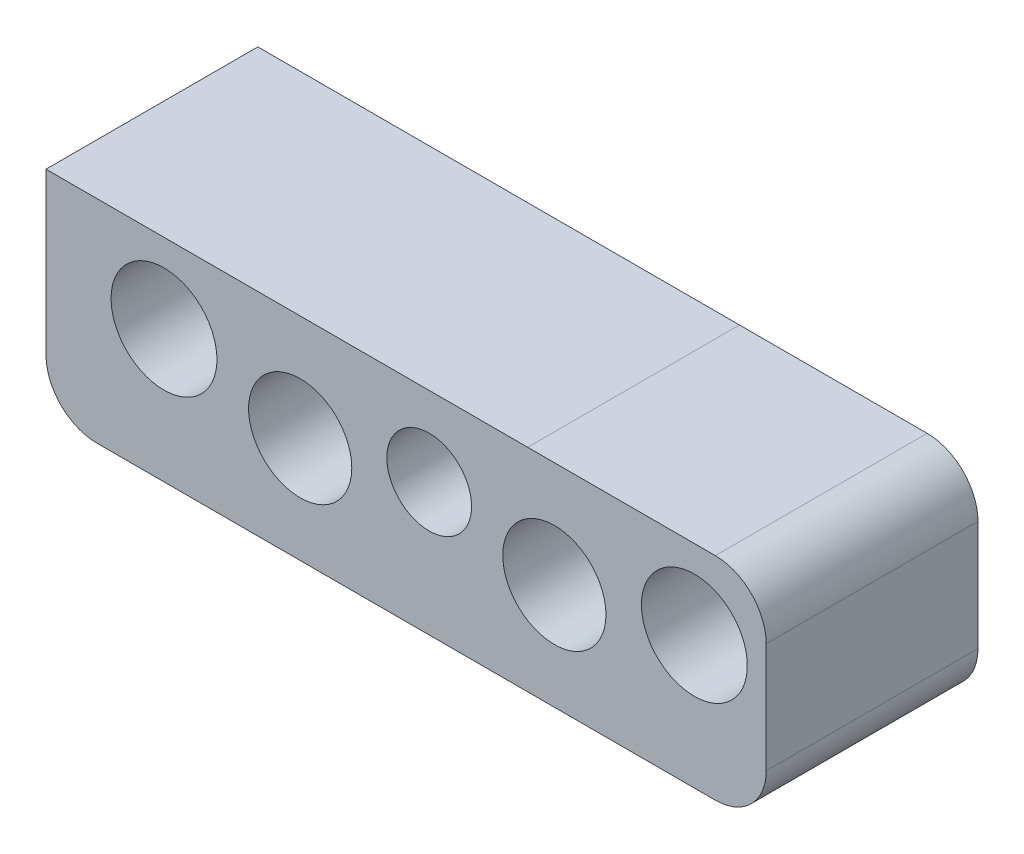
ISO-10303-21;
HEADER;
FILE_DESCRIPTION(('STEP AP214'),'2;1');
FILE_NAME('part.step','',(''),(''),'','','');
FILE_SCHEMA(('AUTOMOTIVE_DESIGN { 1 0 10303 214 1 1 1 1 }'));
ENDSEC;
DATA;
#1=APPLICATION_CONTEXT('core data for automotive mechanical design processes');
#2=APPLICATION_PROTOCOL_DEFINITION('international standard','automotive_design',2000,#1);
#3=PRODUCT_CONTEXT('',#1,'mechanical');
#4=PRODUCT('Part','Part','',(#3));
#5=PRODUCT_RELATED_PRODUCT_CATEGORY('part','',(#4));
#6=PRODUCT_DEFINITION_FORMATION('','',#4);
#7=PRODUCT_DEFINITION_CONTEXT('part definition',#1,'design');
#8=PRODUCT_DEFINITION('design','',#6,#7);
#9=PRODUCT_DEFINITION_SHAPE('','',#8);
#10=(LENGTH_UNIT() NAMED_UNIT(*) SI_UNIT(.MILLI.,.METRE.));
#11=(NAMED_UNIT(*) PLANE_ANGLE_UNIT() SI_UNIT($,.RADIAN.));
#12=(NAMED_UNIT(*) SI_UNIT($,.STERADIAN.) SOLID_ANGLE_UNIT());
#13=UNCERTAINTY_MEASURE_WITH_UNIT(LENGTH_MEASURE(1.E-05),#10,'distance_accuracy_value','');
#14=(GEOMETRIC_REPRESENTATION_CONTEXT(3) GLOBAL_UNCERTAINTY_ASSIGNED_CONTEXT((#13)) GLOBAL_UNIT_ASSIGNED_CONTEXT((#10,
#11,#12)) REPRESENTATION_CONTEXT('',''));
#15=CARTESIAN_POINT('',(0.,0.,0.));
#16=DIRECTION('',(0.,0.,1.));
#17=DIRECTION('',(1.,0.,0.));
#18=AXIS2_PLACEMENT_3D('',#15,#16,#17);
#19=CARTESIAN_POINT('',(-937.768,-19.05,-0.0100000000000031));
#20=DIRECTION('',(0.,1.,0.));
#21=DIRECTION('',(0.,0.,1.));
#22=AXIS2_PLACEMENT_3D('',#19,#20,#21);
#23=PLANE('',#22);
#24=DIRECTION('',(1.,0.,0.));
#25=VECTOR('',#24,1.);
#26=CARTESIAN_POINT('',(0.,-19.05,0.));
#27=LINE('',#26,#25);
#28=CARTESIAN_POINT('',(-865.5685,-19.05,0.));
#29=VERTEX_POINT('',#28);
#30=CARTESIAN_POINT('',(-837.438,-19.05,0.));
#31=VERTEX_POINT('',#30);
#32=EDGE_CURVE('E124',#29,#31,#27,.T.);
#33=ORIENTED_EDGE('',*,*,#32,.F.);
#34=DIRECTION('',(0.,0.,1.));
#35=VECTOR('',#34,1.);
#36=CARTESIAN_POINT('',(-865.5685,-19.05,0.));
#37=LINE('',#36,#35);
#38=CARTESIAN_POINT('',(-865.5685,-19.05,31.75));
#39=VERTEX_POINT('',#38);
#40=EDGE_CURVE('E108',#29,#39,#37,.T.);
#41=ORIENTED_EDGE('',*,*,#40,.T.);
#42=DIRECTION('',(1.,0.,0.));
#43=VECTOR('',#42,1.);
#44=CARTESIAN_POINT('',(0.,-19.05,31.75));
#45=LINE('',#44,#43);
#46=CARTESIAN_POINT('',(-837.438,-19.05,31.75));
#47=VERTEX_POINT('',#46);
#48=EDGE_CURVE('E115',#39,#47,#45,.T.);
#49=ORIENTED_EDGE('',*,*,#48,.T.);
#50=DIRECTION('',(0.,0.,1.));
#51=VECTOR('',#50,1.);
#52=CARTESIAN_POINT('',(-837.438,-19.05,-0.0100000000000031));
#53=LINE('',#52,#51);
#54=EDGE_CURVE('E11',#31,#47,#53,.T.);
#55=ORIENTED_EDGE('',*,*,#54,.F.);
#56=EDGE_LOOP('',(#33,#41,#49,#55));
#57=FACE_BOUND('',#56,.T.);
#58=ADVANCED_FACE('F41',(#57),#23,.T.);
#59=CARTESIAN_POINT('',(-837.438,-26.67,-0.0100000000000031));
#60=DIRECTION('',(0.,0.,1.));
#61=DIRECTION('',(1.,0.,0.));
#62=AXIS2_PLACEMENT_3D('',#59,#60,#61);
#63=CYLINDRICAL_SURFACE('',#62,7.61999999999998);
#64=CARTESIAN_POINT('',(-837.438,-26.67,0.));
#65=DIRECTION('',(0.,0.,-1.));
#66=DIRECTION('',(-1.,0.,0.));
#67=AXIS2_PLACEMENT_3D('',#64,#65,#66);
#68=CIRCLE('',#67,7.61999999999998);
#69=CARTESIAN_POINT('',(-829.818,-26.6700000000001,0.));
#70=VERTEX_POINT('',#69);
#71=EDGE_CURVE('E154',#31,#70,#68,.T.);
#72=ORIENTED_EDGE('',*,*,#71,.F.);
#73=ORIENTED_EDGE('',*,*,#54,.T.);
#74=CARTESIAN_POINT('',(-837.438,-26.67,31.75));
#75=DIRECTION('',(0.,0.,-1.));
#76=DIRECTION('',(-1.,0.,0.));
#77=AXIS2_PLACEMENT_3D('',#74,#75,#76);
#78=CIRCLE('',#77,7.61999999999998);
#79=CARTESIAN_POINT('',(-829.818,-26.6700000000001,31.75));
#80=VERTEX_POINT('',#79);
#81=EDGE_CURVE('E119',#47,#80,#78,.T.);
#82=ORIENTED_EDGE('',*,*,#81,.T.);
#83=DIRECTION('',(0.,0.,1.));
#84=VECTOR('',#83,1.);
#85=CARTESIAN_POINT('',(-829.818,-26.6700000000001,-0.0100000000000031));
#86=LINE('',#85,#84);
#87=EDGE_CURVE('E50',#70,#80,#86,.T.);
#88=ORIENTED_EDGE('',*,*,#87,.F.);
#89=EDGE_LOOP('',(#72,#73,#82,#88));
#90=FACE_BOUND('',#89,.T.);
#91=ADVANCED_FACE('F186',(#90),#63,.T.);
#92=CARTESIAN_POINT('',(-829.818,-26.6700000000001,-0.0100000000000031));
#93=DIRECTION('',(1.,0.,0.));
#94=DIRECTION('',(0.,0.,-1.));
#95=AXIS2_PLACEMENT_3D('',#92,#93,#94);
#96=PLANE('',#95);
#97=DIRECTION('',(0.,-1.,0.));
#98=VECTOR('',#97,1.);
#99=CARTESIAN_POINT('',(-829.818,0.,0.));
#100=LINE('',#99,#98);
#101=CARTESIAN_POINT('',(-829.818,-43.18,0.));
#102=VERTEX_POINT('',#101);
#103=EDGE_CURVE('E157',#70,#102,#100,.T.);
#104=ORIENTED_EDGE('',*,*,#103,.F.);
#105=ORIENTED_EDGE('',*,*,#87,.T.);
#106=DIRECTION('',(0.,-1.,0.));
#107=VECTOR('',#106,1.);
#108=CARTESIAN_POINT('',(-829.818,0.,31.75));
#109=LINE('',#108,#107);
#110=CARTESIAN_POINT('',(-829.818,-43.18,31.75));
#111=VERTEX_POINT('',#110);
#112=EDGE_CURVE('E182',#80,#111,#109,.T.);
#113=ORIENTED_EDGE('',*,*,#112,.T.);
#114=DIRECTION('',(0.,0.,1.));
#115=VECTOR('',#114,1.);
#116=CARTESIAN_POINT('',(-829.818,-43.18,-0.0100000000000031));
#117=LINE('',#116,#115);
#118=EDGE_CURVE('E144',#102,#111,#117,.T.);
#119=ORIENTED_EDGE('',*,*,#118,.F.);
#120=EDGE_LOOP('',(#104,#105,#113,#119));
#121=FACE_BOUND('',#120,.T.);
#122=ADVANCED_FACE('F191',(#121),#96,.T.);
#123=CARTESIAN_POINT('',(-837.438,-43.18,-0.0100000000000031));
#124=DIRECTION('',(0.,0.,1.));
#125=DIRECTION('',(1.,0.,0.));
#126=AXIS2_PLACEMENT_3D('',#123,#124,#125);
#127=CYLINDRICAL_SURFACE('',#126,7.61999999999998);
#128=CARTESIAN_POINT('',(-837.438,-43.18,0.));
#129=DIRECTION('',(0.,0.,-1.));
#130=DIRECTION('',(-1.,0.,0.));
#131=AXIS2_PLACEMENT_3D('',#128,#129,#130);
#132=CIRCLE('',#131,7.61999999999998);
#133=CARTESIAN_POINT('',(-837.438,-50.8,0.));
#134=VERTEX_POINT('',#133);
#135=EDGE_CURVE('E160',#102,#134,#132,.T.);
#136=ORIENTED_EDGE('',*,*,#135,.F.);
#137=ORIENTED_EDGE('',*,*,#118,.T.);
#138=CARTESIAN_POINT('',(-837.438,-43.18,31.75));
#139=DIRECTION('',(0.,0.,-1.));
#140=DIRECTION('',(-1.,0.,0.));
#141=AXIS2_PLACEMENT_3D('',#138,#139,#140);
#142=CIRCLE('',#141,7.61999999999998);
#143=CARTESIAN_POINT('',(-837.438,-50.8,31.75));
#144=VERTEX_POINT('',#143);
#145=EDGE_CURVE('E179',#111,#144,#142,.T.);
#146=ORIENTED_EDGE('',*,*,#145,.T.);
#147=DIRECTION('',(0.,0.,1.));
#148=VECTOR('',#147,1.);
#149=CARTESIAN_POINT('',(-837.438,-50.8,-0.0100000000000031));
#150=LINE('',#149,#148);
#151=EDGE_CURVE('E146',#134,#144,#150,.T.);
#152=ORIENTED_EDGE('',*,*,#151,.F.);
#153=EDGE_LOOP('',(#136,#137,#146,#152));
#154=FACE_BOUND('',#153,.T.);
#155=ADVANCED_FACE('F195',(#154),#127,.T.);
#156=CARTESIAN_POINT('',(-930.148,-50.8,-0.0100000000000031));
#157=DIRECTION('',(0.,-1.,0.));
#158=DIRECTION('',(0.,0.,-1.));
#159=AXIS2_PLACEMENT_3D('',#156,#157,#158);
#160=PLANE('',#159);
#161=DIRECTION('',(-1.,0.,0.));
#162=VECTOR('',#161,1.);
#163=CARTESIAN_POINT('',(0.,-50.8,0.));
#164=LINE('',#163,#162);
#165=CARTESIAN_POINT('',(-930.148,-50.8,0.));
#166=VERTEX_POINT('',#165);
#167=EDGE_CURVE('E163',#134,#166,#164,.T.);
#168=ORIENTED_EDGE('',*,*,#167,.F.);
#169=ORIENTED_EDGE('',*,*,#151,.T.);
#170=DIRECTION('',(-1.,0.,0.));
#171=VECTOR('',#170,1.);
#172=CARTESIAN_POINT('',(0.,-50.8,31.75));
#173=LINE('',#172,#171);
#174=CARTESIAN_POINT('',(-930.148,-50.8,31.75));
#175=VERTEX_POINT('',#174);
#176=EDGE_CURVE('E176',#144,#175,#173,.T.);
#177=ORIENTED_EDGE('',*,*,#176,.T.);
#178=DIRECTION('',(0.,0.,1.));
#179=VECTOR('',#178,1.);
#180=CARTESIAN_POINT('',(-930.148,-50.8,-0.0100000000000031));
#181=LINE('',#180,#179);
#182=EDGE_CURVE('E148',#166,#175,#181,.T.);
#183=ORIENTED_EDGE('',*,*,#182,.F.);
#184=EDGE_LOOP('',(#168,#169,#177,#183));
#185=FACE_BOUND('',#184,.T.);
#186=ADVANCED_FACE('F197',(#185),#160,.T.);
#187=CARTESIAN_POINT('',(-937.768,-19.05,-0.0100000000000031));
#188=DIRECTION('',(-1.,0.,0.));
#189=DIRECTION('',(0.,0.,1.));
#190=AXIS2_PLACEMENT_3D('',#187,#188,#189);
#191=PLANE('',#190);
#192=DIRECTION('',(0.,1.,0.));
#193=VECTOR('',#192,1.);
#194=CARTESIAN_POINT('',(-937.768,0.,0.));
#195=LINE('',#194,#193);
#196=CARTESIAN_POINT('',(-937.768,-43.18,0.));
#197=VERTEX_POINT('',#196);
#198=CARTESIAN_POINT('',(-937.768,-19.05,0.));
#199=VERTEX_POINT('',#198);
#200=EDGE_CURVE('E169',#197,#199,#195,.T.);
#201=ORIENTED_EDGE('',*,*,#200,.F.);
#202=DIRECTION('',(0.,0.,1.));
#203=VECTOR('',#202,1.);
#204=CARTESIAN_POINT('',(-937.768,-43.18,-0.0100000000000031));
#205=LINE('',#204,#203);
#206=CARTESIAN_POINT('',(-937.768,-43.18,31.75));
#207=VERTEX_POINT('',#206);
#208=EDGE_CURVE('E111',#197,#207,#205,.T.);
#209=ORIENTED_EDGE('',*,*,#208,.T.);
#210=DIRECTION('',(0.,1.,0.));
#211=VECTOR('',#210,1.);
#212=CARTESIAN_POINT('',(-937.768,0.,31.75));
#213=LINE('',#212,#211);
#214=CARTESIAN_POINT('',(-937.768,-19.05,31.75));
#215=VERTEX_POINT('',#214);
#216=EDGE_CURVE('E171',#207,#215,#213,.T.);
#217=ORIENTED_EDGE('',*,*,#216,.T.);
#218=DIRECTION('',(0.,0.,1.));
#219=VECTOR('',#218,1.);
#220=CARTESIAN_POINT('',(-937.768,-19.05,-0.0100000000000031));
#221=LINE('',#220,#219);
#222=EDGE_CURVE('E58',#199,#215,#221,.T.);
#223=ORIENTED_EDGE('',*,*,#222,.F.);
#224=EDGE_LOOP('',(#201,#209,#217,#223));
#225=FACE_BOUND('',#224,.T.);
#226=ADVANCED_FACE('F202',(#225),#191,.T.);
#227=CARTESIAN_POINT('',(-930.148,-43.18,-0.0100000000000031));
#228=DIRECTION('',(0.,0.,1.));
#229=DIRECTION('',(1.,0.,0.));
#230=AXIS2_PLACEMENT_3D('',#227,#228,#229);
#231=CYLINDRICAL_SURFACE('',#230,7.61999999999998);
#232=CARTESIAN_POINT('',(-930.148,-43.18,0.));
#233=DIRECTION('',(0.,0.,-1.));
#234=DIRECTION('',(-1.,0.,0.));
#235=AXIS2_PLACEMENT_3D('',#232,#233,#234);
#236=CIRCLE('',#235,7.61999999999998);
#237=EDGE_CURVE('E166',#166,#197,#236,.T.);
#238=ORIENTED_EDGE('',*,*,#237,.F.);
#239=ORIENTED_EDGE('',*,*,#182,.T.);
#240=CARTESIAN_POINT('',(-930.148,-43.18,31.75));
#241=DIRECTION('',(0.,0.,-1.));
#242=DIRECTION('',(-1.,0.,0.));
#243=AXIS2_PLACEMENT_3D('',#240,#241,#242);
#244=CIRCLE('',#243,7.61999999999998);
#245=EDGE_CURVE('E173',#175,#207,#244,.T.);
#246=ORIENTED_EDGE('',*,*,#245,.T.);
#247=ORIENTED_EDGE('',*,*,#208,.F.);
#248=EDGE_LOOP('',(#238,#239,#246,#247));
#249=FACE_BOUND('',#248,.T.);
#250=ADVANCED_FACE('F201',(#249),#231,.T.);
#251=CARTESIAN_POINT('',(-832.643295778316,-30.9504062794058,11.1252));
#252=DIRECTION('',(0.,0.,1.));
#253=DIRECTION('',(1.,0.,0.));
#254=AXIS2_PLACEMENT_3D('',#251,#252,#253);
#255=PLANE('',#254);
#256=CARTESIAN_POINT('',(-840.580795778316,-30.9504062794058,11.1252));
#257=DIRECTION('',(0.,0.,-1.));
#258=DIRECTION('',(-1.,0.,0.));
#259=AXIS2_PLACEMENT_3D('',#256,#257,#258);
#260=CIRCLE('',#259,7.93750000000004);
#261=CARTESIAN_POINT('',(-848.518295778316,-30.9504062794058,11.1252));
#262=VERTEX_POINT('',#261);
#263=EDGE_CURVE('E134',#262,#262,#260,.T.);
#264=ORIENTED_EDGE('',*,*,#263,.F.);
#265=EDGE_LOOP('',(#264));
#266=FACE_BOUND('',#265,.T.);
#267=CARTESIAN_POINT('',(-840.580795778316,-30.9504062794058,11.1252));
#268=DIRECTION('',(0.,0.,-1.));
#269=DIRECTION('',(-1.,0.,0.));
#270=AXIS2_PLACEMENT_3D('',#267,#268,#269);
#271=CIRCLE('',#270,9.92187499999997);
#272=CARTESIAN_POINT('',(-850.502670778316,-30.9504062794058,11.1252));
#273=VERTEX_POINT('',#272);
#274=EDGE_CURVE('E139',#273,#273,#271,.T.);
#275=ORIENTED_EDGE('',*,*,#274,.T.);
#276=EDGE_LOOP('',(#275));
#277=FACE_BOUND('',#276,.T.);
#278=ADVANCED_FACE('F209',(#266,#277),#255,.F.);
#279=CARTESIAN_POINT('',(-873.981795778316,-30.9504062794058,11.1252));
#280=DIRECTION('',(0.,0.,1.));
#281=DIRECTION('',(1.,0.,0.));
#282=AXIS2_PLACEMENT_3D('',#279,#280,#281);
#283=PLANE('',#282);
#284=CARTESIAN_POINT('',(-880.331795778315,-30.9504062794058,11.1252));
#285=DIRECTION('',(0.,0.,-1.));
#286=DIRECTION('',(-1.,0.,0.));
#287=AXIS2_PLACEMENT_3D('',#284,#285,#286);
#288=CIRCLE('',#287,6.34999999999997);
#289=CARTESIAN_POINT('',(-886.681795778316,-30.9504062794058,11.1252));
#290=VERTEX_POINT('',#289);
#291=EDGE_CURVE('E480',#290,#290,#288,.T.);
#292=ORIENTED_EDGE('',*,*,#291,.F.);
#293=EDGE_LOOP('',(#292));
#294=FACE_BOUND('',#293,.T.);
#295=CARTESIAN_POINT('',(-880.331795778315,-30.9504062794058,11.1252));
#296=DIRECTION('',(0.,0.,-1.));
#297=DIRECTION('',(-1.,0.,0.));
#298=AXIS2_PLACEMENT_3D('',#295,#296,#297);
#299=CIRCLE('',#298,8.73124999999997);
#300=CARTESIAN_POINT('',(-889.063045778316,-30.9504062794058,11.1252));
#301=VERTEX_POINT('',#300);
#302=EDGE_CURVE('E477',#301,#301,#299,.T.);
#303=ORIENTED_EDGE('',*,*,#302,.T.);
#304=EDGE_LOOP('',(#303));
#305=FACE_BOUND('',#304,.T.);
#306=ADVANCED_FACE('F227',(#294,#305),#283,.F.);
#307=CARTESIAN_POINT('',(-912.145295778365,-30.9504062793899,4.7752));
#308=DIRECTION('',(0.,0.,1.));
#309=DIRECTION('',(1.,0.,0.));
#310=AXIS2_PLACEMENT_3D('',#307,#308,#309);
#311=PLANE('',#310);
#312=CARTESIAN_POINT('',(-920.082795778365,-30.9504062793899,4.7752));
#313=DIRECTION('',(0.,0.,-1.));
#314=DIRECTION('',(-1.,0.,0.));
#315=AXIS2_PLACEMENT_3D('',#312,#313,#314);
#316=CIRCLE('',#315,7.93750000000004);
#317=CARTESIAN_POINT('',(-928.020295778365,-30.9504062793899,4.7752));
#318=VERTEX_POINT('',#317);
#319=EDGE_CURVE('E468',#318,#318,#316,.T.);
#320=ORIENTED_EDGE('',*,*,#319,.F.);
#321=EDGE_LOOP('',(#320));
#322=FACE_BOUND('',#321,.T.);
#323=CARTESIAN_POINT('',(-920.082795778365,-30.9504062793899,4.7752));
#324=DIRECTION('',(0.,0.,-1.));
#325=DIRECTION('',(-1.,0.,0.));
#326=AXIS2_PLACEMENT_3D('',#323,#324,#325);
#327=CIRCLE('',#326,9.92187499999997);
#328=CARTESIAN_POINT('',(-930.004670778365,-30.9504062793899,4.7752));
#329=VERTEX_POINT('',#328);
#330=EDGE_CURVE('E465',#329,#329,#327,.T.);
#331=ORIENTED_EDGE('',*,*,#330,.T.);
#332=EDGE_LOOP('',(#331));
#333=FACE_BOUND('',#332,.T.);
#334=ADVANCED_FACE('F233',(#322,#333),#311,.F.);
#335=CARTESIAN_POINT('',(-840.580795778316,-30.9504062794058,0.));
#336=DIRECTION('',(0.,0.,-1.));
#337=DIRECTION('',(-1.,0.,0.));
#338=AXIS2_PLACEMENT_3D('',#335,#336,#337);
#339=CYLINDRICAL_SURFACE('',#338,7.93750000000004);
#340=CARTESIAN_POINT('',(-840.580795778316,-30.9504062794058,31.75));
#341=DIRECTION('',(0.,0.,-1.));
#342=DIRECTION('',(-1.,0.,0.));
#343=AXIS2_PLACEMENT_3D('',#340,#341,#342);
#344=CIRCLE('',#343,7.93750000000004);
#345=CARTESIAN_POINT('',(-848.518295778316,-30.9504062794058,31.75));
#346=VERTEX_POINT('',#345);
#347=EDGE_CURVE('E131',#346,#346,#344,.T.);
#348=ORIENTED_EDGE('',*,*,#347,.F.);
#349=EDGE_LOOP('',(#348));
#350=FACE_BOUND('',#349,.T.);
#351=ORIENTED_EDGE('',*,*,#263,.T.);
#352=EDGE_LOOP('',(#351));
#353=FACE_BOUND('',#352,.T.);
#354=ADVANCED_FACE('F241',(#350,#353),#339,.F.);
#355=CARTESIAN_POINT('',(-880.331795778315,-30.9504062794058,0.));
#356=DIRECTION('',(0.,0.,-1.));
#357=DIRECTION('',(-1.,0.,0.));
#358=AXIS2_PLACEMENT_3D('',#355,#356,#357);
#359=CYLINDRICAL_SURFACE('',#358,6.34999999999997);
#360=CARTESIAN_POINT('',(-880.331795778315,-30.9504062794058,31.75));
#361=DIRECTION('',(0.,0.,-1.));
#362=DIRECTION('',(-1.,0.,0.));
#363=AXIS2_PLACEMENT_3D('',#360,#361,#362);
#364=CIRCLE('',#363,6.34999999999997);
#365=CARTESIAN_POINT('',(-886.681795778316,-30.9504062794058,31.75));
#366=VERTEX_POINT('',#365);
#367=EDGE_CURVE('E483',#366,#366,#364,.T.);
#368=ORIENTED_EDGE('',*,*,#367,.F.);
#369=EDGE_LOOP('',(#368));
#370=FACE_BOUND('',#369,.T.);
#371=ORIENTED_EDGE('',*,*,#291,.T.);
#372=EDGE_LOOP('',(#371));
#373=FACE_BOUND('',#372,.T.);
#374=ADVANCED_FACE('F244',(#370,#373),#359,.F.);
#375=CARTESIAN_POINT('',(-920.082795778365,-30.9504062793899,0.));
#376=DIRECTION('',(0.,0.,-1.));
#377=DIRECTION('',(-1.,0.,0.));
#378=AXIS2_PLACEMENT_3D('',#375,#376,#377);
#379=CYLINDRICAL_SURFACE('',#378,7.93750000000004);
#380=CARTESIAN_POINT('',(-920.082795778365,-30.9504062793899,31.75));
#381=DIRECTION('',(0.,0.,-1.));
#382=DIRECTION('',(-1.,0.,0.));
#383=AXIS2_PLACEMENT_3D('',#380,#381,#382);
#384=CIRCLE('',#383,7.93750000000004);
#385=CARTESIAN_POINT('',(-928.020295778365,-30.9504062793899,31.75));
#386=VERTEX_POINT('',#385);
#387=EDGE_CURVE('E471',#386,#386,#384,.T.);
#388=ORIENTED_EDGE('',*,*,#387,.F.);
#389=EDGE_LOOP('',(#388));
#390=FACE_BOUND('',#389,.T.);
#391=ORIENTED_EDGE('',*,*,#319,.T.);
#392=EDGE_LOOP('',(#391));
#393=FACE_BOUND('',#392,.T.);
#394=ADVANCED_FACE('F319',(#390,#393),#379,.F.);
#395=CARTESIAN_POINT('',(0.,0.,31.75));
#396=DIRECTION('',(0.,0.,-1.));
#397=DIRECTION('',(-1.,0.,0.));
#398=AXIS2_PLACEMENT_3D('',#395,#396,#397);
#399=PLANE('',#398);
#400=CARTESIAN_POINT('',(-899.668,-34.925,31.75));
#401=DIRECTION('',(0.,0.,1.));
#402=DIRECTION('',(1.,0.,0.));
#403=AXIS2_PLACEMENT_3D('',#400,#401,#402);
#404=CIRCLE('',#403,7.73429999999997);
#405=CARTESIAN_POINT('',(-891.9337,-34.925,31.75));
#406=VERTEX_POINT('',#405);
#407=EDGE_CURVE('E449',#406,#406,#404,.T.);
#408=ORIENTED_EDGE('',*,*,#407,.F.);
#409=EDGE_LOOP('',(#408));
#410=FACE_BOUND('',#409,.T.);
#411=CARTESIAN_POINT('',(-861.568,-34.925,31.75));
#412=DIRECTION('',(0.,0.,1.));
#413=DIRECTION('',(1.,0.,0.));
#414=AXIS2_PLACEMENT_3D('',#411,#412,#413);
#415=CIRCLE('',#414,7.73429999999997);
#416=CARTESIAN_POINT('',(-853.8337,-34.925,31.75));
#417=VERTEX_POINT('',#416);
#418=EDGE_CURVE('E125',#417,#417,#415,.T.);
#419=ORIENTED_EDGE('',*,*,#418,.F.);
#420=EDGE_LOOP('',(#419));
#421=FACE_BOUND('',#420,.T.);
#422=ORIENTED_EDGE('',*,*,#387,.T.);
#423=EDGE_LOOP('',(#422));
#424=FACE_BOUND('',#423,.T.);
#425=ORIENTED_EDGE('',*,*,#367,.T.);
#426=EDGE_LOOP('',(#425));
#427=FACE_BOUND('',#426,.T.);
#428=ORIENTED_EDGE('',*,*,#347,.T.);
#429=EDGE_LOOP('',(#428));
#430=FACE_BOUND('',#429,.T.);
#431=ORIENTED_EDGE('',*,*,#216,.F.);
#432=ORIENTED_EDGE('',*,*,#245,.F.);
#433=ORIENTED_EDGE('',*,*,#176,.F.);
#434=ORIENTED_EDGE('',*,*,#145,.F.);
#435=ORIENTED_EDGE('',*,*,#112,.F.);
#436=ORIENTED_EDGE('',*,*,#81,.F.);
#437=ORIENTED_EDGE('',*,*,#48,.F.);
#438=DIRECTION('',(1.,0.,0.));
#439=VECTOR('',#438,1.);
#440=CARTESIAN_POINT('',(-1014.2855,-19.05,31.75));
#441=LINE('',#440,#439);
#442=EDGE_CURVE('E45',#215,#39,#441,.T.);
#443=ORIENTED_EDGE('',*,*,#442,.F.);
#444=EDGE_LOOP('',(#431,#432,#433,#434,#435,#436,#437,#443));
#445=FACE_BOUND('',#444,.T.);
#446=ADVANCED_FACE('F116',(#410,#421,#424,#427,#430,#445),#399,.F.);
#447=CARTESIAN_POINT('',(-920.082795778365,-30.9504062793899,0.));
#448=DIRECTION('',(0.,0.,-1.));
#449=DIRECTION('',(-1.,0.,0.));
#450=AXIS2_PLACEMENT_3D('',#447,#448,#449);
#451=CYLINDRICAL_SURFACE('',#450,9.92187499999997);
#452=ORIENTED_EDGE('',*,*,#330,.F.);
#453=EDGE_LOOP('',(#452));
#454=FACE_BOUND('',#453,.T.);
#455=CARTESIAN_POINT('',(-920.082795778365,-30.9504062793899,0.));
#456=DIRECTION('',(0.,0.,-1.));
#457=DIRECTION('',(-1.,0.,0.));
#458=AXIS2_PLACEMENT_3D('',#455,#456,#457);
#459=CIRCLE('',#458,9.92187499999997);
#460=CARTESIAN_POINT('',(-930.004670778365,-30.9504062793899,0.));
#461=VERTEX_POINT('',#460);
#462=EDGE_CURVE('E152',#461,#461,#459,.T.);
#463=ORIENTED_EDGE('',*,*,#462,.T.);
#464=EDGE_LOOP('',(#463));
#465=FACE_BOUND('',#464,.T.);
#466=ADVANCED_FACE('F337',(#454,#465),#451,.F.);
#467=CARTESIAN_POINT('',(-880.331795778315,-30.9504062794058,0.));
#468=DIRECTION('',(0.,0.,-1.));
#469=DIRECTION('',(-1.,0.,0.));
#470=AXIS2_PLACEMENT_3D('',#467,#468,#469);
#471=CYLINDRICAL_SURFACE('',#470,8.73124999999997);
#472=ORIENTED_EDGE('',*,*,#302,.F.);
#473=EDGE_LOOP('',(#472));
#474=FACE_BOUND('',#473,.T.);
#475=CARTESIAN_POINT('',(-880.331795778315,-30.9504062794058,0.));
#476=DIRECTION('',(0.,0.,-1.));
#477=DIRECTION('',(-1.,0.,0.));
#478=AXIS2_PLACEMENT_3D('',#475,#476,#477);
#479=CIRCLE('',#478,8.73124999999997);
#480=CARTESIAN_POINT('',(-889.063045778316,-30.9504062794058,0.));
#481=VERTEX_POINT('',#480);
#482=EDGE_CURVE('E474',#481,#481,#479,.T.);
#483=ORIENTED_EDGE('',*,*,#482,.T.);
#484=EDGE_LOOP('',(#483));
#485=FACE_BOUND('',#484,.T.);
#486=ADVANCED_FACE('F345',(#474,#485),#471,.F.);
#487=CARTESIAN_POINT('',(-840.580795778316,-30.9504062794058,0.));
#488=DIRECTION('',(0.,0.,-1.));
#489=DIRECTION('',(-1.,0.,0.));
#490=AXIS2_PLACEMENT_3D('',#487,#488,#489);
#491=CYLINDRICAL_SURFACE('',#490,9.92187499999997);
#492=ORIENTED_EDGE('',*,*,#274,.F.);
#493=EDGE_LOOP('',(#492));
#494=FACE_BOUND('',#493,.T.);
#495=CARTESIAN_POINT('',(-840.580795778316,-30.9504062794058,0.));
#496=DIRECTION('',(0.,0.,-1.));
#497=DIRECTION('',(-1.,0.,0.));
#498=AXIS2_PLACEMENT_3D('',#495,#496,#497);
#499=CIRCLE('',#498,9.92187499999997);
#500=CARTESIAN_POINT('',(-850.502670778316,-30.9504062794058,0.));
#501=VERTEX_POINT('',#500);
#502=EDGE_CURVE('E486',#501,#501,#499,.T.);
#503=ORIENTED_EDGE('',*,*,#502,.T.);
#504=EDGE_LOOP('',(#503));
#505=FACE_BOUND('',#504,.T.);
#506=ADVANCED_FACE('F214',(#494,#505),#491,.F.);
#507=CARTESIAN_POINT('',(0.,0.,0.));
#508=DIRECTION('',(0.,0.,-1.));
#509=DIRECTION('',(-1.,0.,0.));
#510=AXIS2_PLACEMENT_3D('',#507,#508,#509);
#511=PLANE('',#510);
#512=CARTESIAN_POINT('',(-899.668,-34.925,0.));
#513=DIRECTION('',(0.,0.,1.));
#514=DIRECTION('',(1.,0.,0.));
#515=AXIS2_PLACEMENT_3D('',#512,#513,#514);
#516=CIRCLE('',#515,5.15619999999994);
#517=CARTESIAN_POINT('',(-894.5118,-34.925,0.));
#518=VERTEX_POINT('',#517);
#519=EDGE_CURVE('E442',#518,#518,#516,.T.);
#520=ORIENTED_EDGE('',*,*,#519,.T.);
#521=EDGE_LOOP('',(#520));
#522=FACE_BOUND('',#521,.T.);
#523=CARTESIAN_POINT('',(-861.568,-34.925,0.));
#524=DIRECTION('',(0.,0.,1.));
#525=DIRECTION('',(1.,0.,0.));
#526=AXIS2_PLACEMENT_3D('',#523,#524,#525);
#527=CIRCLE('',#526,5.15619999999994);
#528=CARTESIAN_POINT('',(-856.4118,-34.925,0.));
#529=VERTEX_POINT('',#528);
#530=EDGE_CURVE('E455',#529,#529,#527,.T.);
#531=ORIENTED_EDGE('',*,*,#530,.T.);
#532=EDGE_LOOP('',(#531));
#533=FACE_BOUND('',#532,.T.);
#534=ORIENTED_EDGE('',*,*,#502,.F.);
#535=EDGE_LOOP('',(#534));
#536=FACE_BOUND('',#535,.T.);
#537=ORIENTED_EDGE('',*,*,#482,.F.);
#538=EDGE_LOOP('',(#537));
#539=FACE_BOUND('',#538,.T.);
#540=ORIENTED_EDGE('',*,*,#462,.F.);
#541=EDGE_LOOP('',(#540));
#542=FACE_BOUND('',#541,.T.);
#543=ORIENTED_EDGE('',*,*,#237,.T.);
#544=ORIENTED_EDGE('',*,*,#200,.T.);
#545=DIRECTION('',(1.,0.,0.));
#546=VECTOR('',#545,1.);
#547=CARTESIAN_POINT('',(-1014.2855,-19.05,0.));
#548=LINE('',#547,#546);
#549=EDGE_CURVE('E112',#199,#29,#548,.T.);
#550=ORIENTED_EDGE('',*,*,#549,.T.);
#551=ORIENTED_EDGE('',*,*,#32,.T.);
#552=ORIENTED_EDGE('',*,*,#71,.T.);
#553=ORIENTED_EDGE('',*,*,#103,.T.);
#554=ORIENTED_EDGE('',*,*,#135,.T.);
#555=ORIENTED_EDGE('',*,*,#167,.T.);
#556=EDGE_LOOP('',(#543,#544,#550,#551,#552,#553,#554,#555));
#557=FACE_BOUND('',#556,.T.);
#558=ADVANCED_FACE('F43',(#522,#533,#536,#539,#542,#557),#511,.T.);
#559=CARTESIAN_POINT('',(-1014.2855,-19.05,0.));
#560=DIRECTION('',(0.,-1.,0.));
#561=DIRECTION('',(1.,0.,0.));
#562=AXIS2_PLACEMENT_3D('',#559,#560,#561);
#563=PLANE('',#562);
#564=ORIENTED_EDGE('',*,*,#549,.F.);
#565=ORIENTED_EDGE('',*,*,#222,.T.);
#566=ORIENTED_EDGE('',*,*,#442,.T.);
#567=ORIENTED_EDGE('',*,*,#40,.F.);
#568=EDGE_LOOP('',(#564,#565,#566,#567));
#569=FACE_BOUND('',#568,.T.);
#570=ADVANCED_FACE('F106',(#569),#563,.F.);
#571=CARTESIAN_POINT('',(-861.568,-34.925,31.75));
#572=DIRECTION('',(0.,0.,1.));
#573=DIRECTION('',(1.,0.,0.));
#574=AXIS2_PLACEMENT_3D('',#571,#572,#573);
#575=CYLINDRICAL_SURFACE('',#574,7.73429999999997);
#576=CARTESIAN_POINT('',(-861.568,-34.925,14.224));
#577=DIRECTION('',(0.,0.,1.));
#578=DIRECTION('',(1.,0.,0.));
#579=AXIS2_PLACEMENT_3D('',#576,#577,#578);
#580=CIRCLE('',#579,7.73429999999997);
#581=CARTESIAN_POINT('',(-853.8337,-34.925,14.224));
#582=VERTEX_POINT('',#581);
#583=EDGE_CURVE('E128',#582,#582,#580,.T.);
#584=ORIENTED_EDGE('',*,*,#583,.F.);
#585=EDGE_LOOP('',(#584));
#586=FACE_BOUND('',#585,.T.);
#587=ORIENTED_EDGE('',*,*,#418,.T.);
#588=EDGE_LOOP('',(#587));
#589=FACE_BOUND('',#588,.T.);
#590=ADVANCED_FACE('F217',(#586,#589),#575,.F.);
#591=CARTESIAN_POINT('',(-856.4118,-34.925,14.224));
#592=DIRECTION('',(0.,0.,-1.));
#593=DIRECTION('',(-1.,0.,0.));
#594=AXIS2_PLACEMENT_3D('',#591,#592,#593);
#595=PLANE('',#594);
#596=CARTESIAN_POINT('',(-861.568,-34.925,14.224));
#597=DIRECTION('',(0.,0.,1.));
#598=DIRECTION('',(1.,0.,0.));
#599=AXIS2_PLACEMENT_3D('',#596,#597,#598);
#600=CIRCLE('',#599,5.15619999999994);
#601=CARTESIAN_POINT('',(-856.4118,-34.925,14.224));
#602=VERTEX_POINT('',#601);
#603=EDGE_CURVE('E458',#602,#602,#600,.T.);
#604=ORIENTED_EDGE('',*,*,#603,.F.);
#605=EDGE_LOOP('',(#604));
#606=FACE_BOUND('',#605,.T.);
#607=ORIENTED_EDGE('',*,*,#583,.T.);
#608=EDGE_LOOP('',(#607));
#609=FACE_BOUND('',#608,.T.);
#610=ADVANCED_FACE('F223',(#606,#609),#595,.F.);
#611=CARTESIAN_POINT('',(-861.568,-34.925,31.75));
#612=DIRECTION('',(0.,0.,1.));
#613=DIRECTION('',(1.,0.,0.));
#614=AXIS2_PLACEMENT_3D('',#611,#612,#613);
#615=CYLINDRICAL_SURFACE('',#614,5.15619999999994);
#616=ORIENTED_EDGE('',*,*,#530,.F.);
#617=EDGE_LOOP('',(#616));
#618=FACE_BOUND('',#617,.T.);
#619=ORIENTED_EDGE('',*,*,#603,.T.);
#620=EDGE_LOOP('',(#619));
#621=FACE_BOUND('',#620,.T.);
#622=ADVANCED_FACE('F386',(#618,#621),#615,.F.);
#623=CARTESIAN_POINT('',(-899.668,-34.925,31.75));
#624=DIRECTION('',(0.,0.,1.));
#625=DIRECTION('',(1.,0.,0.));
#626=AXIS2_PLACEMENT_3D('',#623,#624,#625);
#627=CYLINDRICAL_SURFACE('',#626,7.73429999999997);
#628=CARTESIAN_POINT('',(-899.668,-34.925,14.224));
#629=DIRECTION('',(0.,0.,1.));
#630=DIRECTION('',(1.,0.,0.));
#631=AXIS2_PLACEMENT_3D('',#628,#629,#630);
#632=CIRCLE('',#631,7.73429999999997);
#633=CARTESIAN_POINT('',(-891.9337,-34.925,14.224));
#634=VERTEX_POINT('',#633);
#635=EDGE_CURVE('E446',#634,#634,#632,.T.);
#636=ORIENTED_EDGE('',*,*,#635,.F.);
#637=EDGE_LOOP('',(#636));
#638=FACE_BOUND('',#637,.T.);
#639=ORIENTED_EDGE('',*,*,#407,.T.);
#640=EDGE_LOOP('',(#639));
#641=FACE_BOUND('',#640,.T.);
#642=ADVANCED_FACE('F397',(#638,#641),#627,.F.);
#643=CARTESIAN_POINT('',(-894.5118,-34.925,14.224));
#644=DIRECTION('',(0.,0.,-1.));
#645=DIRECTION('',(-1.,0.,0.));
#646=AXIS2_PLACEMENT_3D('',#643,#644,#645);
#647=PLANE('',#646);
#648=CARTESIAN_POINT('',(-899.668,-34.925,14.224));
#649=DIRECTION('',(0.,0.,1.));
#650=DIRECTION('',(1.,0.,0.));
#651=AXIS2_PLACEMENT_3D('',#648,#649,#650);
#652=CIRCLE('',#651,5.15619999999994);
#653=CARTESIAN_POINT('',(-894.5118,-34.925,14.224));
#654=VERTEX_POINT('',#653);
#655=EDGE_CURVE('E445',#654,#654,#652,.T.);
#656=ORIENTED_EDGE('',*,*,#655,.F.);
#657=EDGE_LOOP('',(#656));
#658=FACE_BOUND('',#657,.T.);
#659=ORIENTED_EDGE('',*,*,#635,.T.);
#660=EDGE_LOOP('',(#659));
#661=FACE_BOUND('',#660,.T.);
#662=ADVANCED_FACE('F408',(#658,#661),#647,.F.);
#663=CARTESIAN_POINT('',(-899.668,-34.925,31.75));
#664=DIRECTION('',(0.,0.,1.));
#665=DIRECTION('',(1.,0.,0.));
#666=AXIS2_PLACEMENT_3D('',#663,#664,#665);
#667=CYLINDRICAL_SURFACE('',#666,5.15619999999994);
#668=ORIENTED_EDGE('',*,*,#519,.F.);
#669=EDGE_LOOP('',(#668));
#670=FACE_BOUND('',#669,.T.);
#671=ORIENTED_EDGE('',*,*,#655,.T.);
#672=EDGE_LOOP('',(#671));
#673=FACE_BOUND('',#672,.T.);
#674=ADVANCED_FACE('F419',(#670,#673),#667,.F.);
#675=CLOSED_SHELL('',(#58,#91,#122,#155,#186,#226,#250,#278,#306,#334,#354,#374,#394,#446,#466,
#486,#506,#558,#570,#590,#610,#622,#642,#662,#674));
#676=MANIFOLD_SOLID_BREP('B2',#675);
#677=ADVANCED_BREP_SHAPE_REPRESENTATION('',(#18,#676),#14);
#678=SHAPE_DEFINITION_REPRESENTATION(#9,#677);
ENDSEC;
END-ISO-10303-21;
